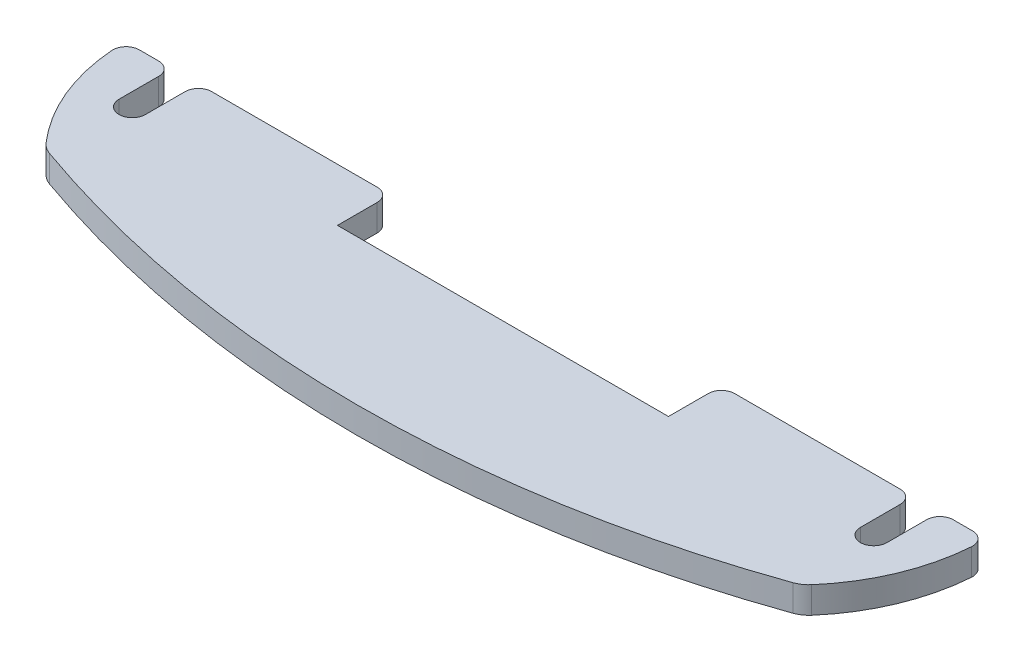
ISO-10303-21;
HEADER;
FILE_DESCRIPTION(('STEP AP214'),'2;1');
FILE_NAME('part.step','',(''),(''),'','','');
FILE_SCHEMA(('AUTOMOTIVE_DESIGN { 1 0 10303 214 1 1 1 1 }'));
ENDSEC;
DATA;
#1=APPLICATION_CONTEXT('core data for automotive mechanical design processes');
#2=APPLICATION_PROTOCOL_DEFINITION('international standard','automotive_design',2000,#1);
#3=PRODUCT_CONTEXT('',#1,'mechanical');
#4=PRODUCT('Part','Part','',(#3));
#5=PRODUCT_RELATED_PRODUCT_CATEGORY('part','',(#4));
#6=PRODUCT_DEFINITION_FORMATION('','',#4);
#7=PRODUCT_DEFINITION_CONTEXT('part definition',#1,'design');
#8=PRODUCT_DEFINITION('design','',#6,#7);
#9=PRODUCT_DEFINITION_SHAPE('','',#8);
#10=(LENGTH_UNIT() NAMED_UNIT(*) SI_UNIT(.MILLI.,.METRE.));
#11=(NAMED_UNIT(*) PLANE_ANGLE_UNIT() SI_UNIT($,.RADIAN.));
#12=(NAMED_UNIT(*) SI_UNIT($,.STERADIAN.) SOLID_ANGLE_UNIT());
#13=UNCERTAINTY_MEASURE_WITH_UNIT(LENGTH_MEASURE(1.E-05),#10,'distance_accuracy_value','');
#14=(GEOMETRIC_REPRESENTATION_CONTEXT(3) GLOBAL_UNCERTAINTY_ASSIGNED_CONTEXT((#13)) GLOBAL_UNIT_ASSIGNED_CONTEXT((#10,
#11,#12)) REPRESENTATION_CONTEXT('',''));
#15=CARTESIAN_POINT('',(0.,0.,0.));
#16=DIRECTION('',(0.,0.,1.));
#17=DIRECTION('',(1.,0.,0.));
#18=AXIS2_PLACEMENT_3D('',#15,#16,#17);
#19=CARTESIAN_POINT('',(12.5,2.,0.));
#20=DIRECTION('',(1.,0.,0.));
#21=DIRECTION('',(0.,0.,-1.));
#22=AXIS2_PLACEMENT_3D('',#19,#20,#21);
#23=PLANE('',#22);
#24=DIRECTION('',(0.,0.,1.));
#25=VECTOR('',#24,1.);
#26=CARTESIAN_POINT('',(12.5,0.,0.));
#27=LINE('',#26,#25);
#28=CARTESIAN_POINT('',(12.5,0.,-2.99999999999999));
#29=VERTEX_POINT('',#28);
#30=CARTESIAN_POINT('',(12.5,0.,0.));
#31=VERTEX_POINT('',#30);
#32=EDGE_CURVE('E236',#29,#31,#27,.T.);
#33=ORIENTED_EDGE('',*,*,#32,.T.);
#34=DIRECTION('',(0.,-1.,0.));
#35=VECTOR('',#34,1.);
#36=CARTESIAN_POINT('',(12.5,2.,0.));
#37=LINE('',#36,#35);
#38=CARTESIAN_POINT('',(12.5,2.,0.));
#39=VERTEX_POINT('',#38);
#40=EDGE_CURVE('E11',#39,#31,#37,.T.);
#41=ORIENTED_EDGE('',*,*,#40,.F.);
#42=DIRECTION('',(0.,0.,1.));
#43=VECTOR('',#42,1.);
#44=CARTESIAN_POINT('',(12.5,2.,0.));
#45=LINE('',#44,#43);
#46=CARTESIAN_POINT('',(12.5,2.,-2.99999999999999));
#47=VERTEX_POINT('',#46);
#48=EDGE_CURVE('E287',#47,#39,#45,.T.);
#49=ORIENTED_EDGE('',*,*,#48,.F.);
#50=DIRECTION('',(0.,-1.,0.));
#51=VECTOR('',#50,1.);
#52=CARTESIAN_POINT('',(12.5,2.,-2.99999999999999));
#53=LINE('',#52,#51);
#54=EDGE_CURVE('E232',#47,#29,#53,.T.);
#55=ORIENTED_EDGE('',*,*,#54,.T.);
#56=EDGE_LOOP('',(#33,#41,#49,#55));
#57=FACE_BOUND('',#56,.T.);
#58=ADVANCED_FACE('F32',(#57),#23,.F.);
#59=CARTESIAN_POINT('',(-12.5,2.,0.));
#60=DIRECTION('',(0.,0.,1.));
#61=DIRECTION('',(1.,0.,0.));
#62=AXIS2_PLACEMENT_3D('',#59,#60,#61);
#63=PLANE('',#62);
#64=DIRECTION('',(-1.,0.,0.));
#65=VECTOR('',#64,1.);
#66=CARTESIAN_POINT('',(-12.5,0.,0.));
#67=LINE('',#66,#65);
#68=CARTESIAN_POINT('',(-12.5,0.,0.));
#69=VERTEX_POINT('',#68);
#70=EDGE_CURVE('E239',#31,#69,#67,.T.);
#71=ORIENTED_EDGE('',*,*,#70,.T.);
#72=DIRECTION('',(0.,-1.,0.));
#73=VECTOR('',#72,1.);
#74=CARTESIAN_POINT('',(-12.5,2.,0.));
#75=LINE('',#74,#73);
#76=CARTESIAN_POINT('',(-12.5,2.,0.));
#77=VERTEX_POINT('',#76);
#78=EDGE_CURVE('E40',#77,#69,#75,.T.);
#79=ORIENTED_EDGE('',*,*,#78,.F.);
#80=DIRECTION('',(-1.,0.,0.));
#81=VECTOR('',#80,1.);
#82=CARTESIAN_POINT('',(-12.5,2.,0.));
#83=LINE('',#82,#81);
#84=EDGE_CURVE('E145',#39,#77,#83,.T.);
#85=ORIENTED_EDGE('',*,*,#84,.F.);
#86=ORIENTED_EDGE('',*,*,#40,.T.);
#87=EDGE_LOOP('',(#71,#79,#85,#86));
#88=FACE_BOUND('',#87,.T.);
#89=ADVANCED_FACE('F435',(#88),#63,.F.);
#90=CARTESIAN_POINT('',(-12.5,2.,0.));
#91=DIRECTION('',(-1.,0.,0.));
#92=DIRECTION('',(0.,0.,1.));
#93=AXIS2_PLACEMENT_3D('',#90,#91,#92);
#94=PLANE('',#93);
#95=DIRECTION('',(0.,0.,-1.));
#96=VECTOR('',#95,1.);
#97=CARTESIAN_POINT('',(-12.5,0.,0.));
#98=LINE('',#97,#96);
#99=CARTESIAN_POINT('',(-12.5,0.,-2.99999999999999));
#100=VERTEX_POINT('',#99);
#101=EDGE_CURVE('E241',#69,#100,#98,.T.);
#102=ORIENTED_EDGE('',*,*,#101,.T.);
#103=DIRECTION('',(0.,-1.,0.));
#104=VECTOR('',#103,1.);
#105=CARTESIAN_POINT('',(-12.5,2.,-2.99999999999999));
#106=LINE('',#105,#104);
#107=CARTESIAN_POINT('',(-12.5,2.,-2.99999999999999));
#108=VERTEX_POINT('',#107);
#109=EDGE_CURVE('E348',#108,#100,#106,.T.);
#110=ORIENTED_EDGE('',*,*,#109,.F.);
#111=DIRECTION('',(0.,0.,-1.));
#112=VECTOR('',#111,1.);
#113=CARTESIAN_POINT('',(-12.5,2.,0.));
#114=LINE('',#113,#112);
#115=EDGE_CURVE('E356',#77,#108,#114,.T.);
#116=ORIENTED_EDGE('',*,*,#115,.F.);
#117=ORIENTED_EDGE('',*,*,#78,.T.);
#118=EDGE_LOOP('',(#102,#110,#116,#117));
#119=FACE_BOUND('',#118,.T.);
#120=ADVANCED_FACE('F354',(#119),#94,.F.);
#121=CARTESIAN_POINT('',(-13.5,2.,-3.));
#122=DIRECTION('',(0.,-1.,0.));
#123=DIRECTION('',(0.,0.,-1.));
#124=AXIS2_PLACEMENT_3D('',#121,#122,#123);
#125=CYLINDRICAL_SURFACE('',#124,1.);
#126=CARTESIAN_POINT('',(-13.5,0.,-3.));
#127=DIRECTION('',(0.,1.,0.));
#128=DIRECTION('',(0.,0.,-1.));
#129=AXIS2_PLACEMENT_3D('',#126,#127,#128);
#130=CIRCLE('',#129,1.);
#131=CARTESIAN_POINT('',(-13.5,0.,-4.));
#132=VERTEX_POINT('',#131);
#133=EDGE_CURVE('E243',#100,#132,#130,.T.);
#134=ORIENTED_EDGE('',*,*,#133,.T.);
#135=DIRECTION('',(0.,-1.,0.));
#136=VECTOR('',#135,1.);
#137=CARTESIAN_POINT('',(-13.5,2.,-4.));
#138=LINE('',#137,#136);
#139=CARTESIAN_POINT('',(-13.5,2.,-4.));
#140=VERTEX_POINT('',#139);
#141=EDGE_CURVE('E345',#140,#132,#138,.T.);
#142=ORIENTED_EDGE('',*,*,#141,.F.);
#143=CARTESIAN_POINT('',(-13.5,2.,-3.));
#144=DIRECTION('',(0.,1.,0.));
#145=DIRECTION('',(0.,0.,-1.));
#146=AXIS2_PLACEMENT_3D('',#143,#144,#145);
#147=CIRCLE('',#146,1.);
#148=EDGE_CURVE('E374',#108,#140,#147,.T.);
#149=ORIENTED_EDGE('',*,*,#148,.F.);
#150=ORIENTED_EDGE('',*,*,#109,.T.);
#151=EDGE_LOOP('',(#134,#142,#149,#150));
#152=FACE_BOUND('',#151,.T.);
#153=ADVANCED_FACE('F365',(#152),#125,.T.);
#154=CARTESIAN_POINT('',(-13.5,2.,-4.));
#155=DIRECTION('',(0.,0.,1.));
#156=DIRECTION('',(1.,0.,0.));
#157=AXIS2_PLACEMENT_3D('',#154,#155,#156);
#158=PLANE('',#157);
#159=DIRECTION('',(-1.,0.,0.));
#160=VECTOR('',#159,1.);
#161=CARTESIAN_POINT('',(-13.5,0.,-4.));
#162=LINE('',#161,#160);
#163=CARTESIAN_POINT('',(-26.,0.,-4.));
#164=VERTEX_POINT('',#163);
#165=EDGE_CURVE('E245',#132,#164,#162,.T.);
#166=ORIENTED_EDGE('',*,*,#165,.T.);
#167=DIRECTION('',(0.,-1.,0.));
#168=VECTOR('',#167,1.);
#169=CARTESIAN_POINT('',(-26.,2.,-4.));
#170=LINE('',#169,#168);
#171=CARTESIAN_POINT('',(-26.,2.,-4.));
#172=VERTEX_POINT('',#171);
#173=EDGE_CURVE('E342',#172,#164,#170,.T.);
#174=ORIENTED_EDGE('',*,*,#173,.F.);
#175=DIRECTION('',(-1.,0.,0.));
#176=VECTOR('',#175,1.);
#177=CARTESIAN_POINT('',(-13.5,2.,-4.));
#178=LINE('',#177,#176);
#179=EDGE_CURVE('E371',#140,#172,#178,.T.);
#180=ORIENTED_EDGE('',*,*,#179,.F.);
#181=ORIENTED_EDGE('',*,*,#141,.T.);
#182=EDGE_LOOP('',(#166,#174,#180,#181));
#183=FACE_BOUND('',#182,.T.);
#184=ADVANCED_FACE('F369',(#183),#158,.F.);
#185=CARTESIAN_POINT('',(-26.,2.,-3.));
#186=DIRECTION('',(0.,-1.,0.));
#187=DIRECTION('',(0.,0.,-1.));
#188=AXIS2_PLACEMENT_3D('',#185,#186,#187);
#189=CYLINDRICAL_SURFACE('',#188,1.);
#190=CARTESIAN_POINT('',(-26.,0.,-3.));
#191=DIRECTION('',(0.,1.,0.));
#192=DIRECTION('',(0.,0.,-1.));
#193=AXIS2_PLACEMENT_3D('',#190,#191,#192);
#194=CIRCLE('',#193,1.);
#195=CARTESIAN_POINT('',(-27.,0.,-2.99999999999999));
#196=VERTEX_POINT('',#195);
#197=EDGE_CURVE('E247',#164,#196,#194,.T.);
#198=ORIENTED_EDGE('',*,*,#197,.T.);
#199=DIRECTION('',(0.,-1.,0.));
#200=VECTOR('',#199,1.);
#201=CARTESIAN_POINT('',(-27.,2.,-2.99999999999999));
#202=LINE('',#201,#200);
#203=CARTESIAN_POINT('',(-27.,2.,-2.99999999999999));
#204=VERTEX_POINT('',#203);
#205=EDGE_CURVE('E339',#204,#196,#202,.T.);
#206=ORIENTED_EDGE('',*,*,#205,.F.);
#207=CARTESIAN_POINT('',(-26.,2.,-3.));
#208=DIRECTION('',(0.,1.,0.));
#209=DIRECTION('',(0.,0.,-1.));
#210=AXIS2_PLACEMENT_3D('',#207,#208,#209);
#211=CIRCLE('',#210,1.);
#212=EDGE_CURVE('E373',#172,#204,#211,.T.);
#213=ORIENTED_EDGE('',*,*,#212,.F.);
#214=ORIENTED_EDGE('',*,*,#173,.T.);
#215=EDGE_LOOP('',(#198,#206,#213,#214));
#216=FACE_BOUND('',#215,.T.);
#217=ADVANCED_FACE('F448',(#216),#189,.T.);
#218=CARTESIAN_POINT('',(-27.,2.,-2.99999999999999));
#219=DIRECTION('',(1.,0.,0.));
#220=DIRECTION('',(0.,0.,-1.));
#221=AXIS2_PLACEMENT_3D('',#218,#219,#220);
#222=PLANE('',#221);
#223=DIRECTION('',(0.,0.,1.));
#224=VECTOR('',#223,1.);
#225=CARTESIAN_POINT('',(-27.,0.,-2.99999999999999));
#226=LINE('',#225,#224);
#227=CARTESIAN_POINT('',(-27.,0.,0.));
#228=VERTEX_POINT('',#227);
#229=EDGE_CURVE('E249',#196,#228,#226,.T.);
#230=ORIENTED_EDGE('',*,*,#229,.T.);
#231=DIRECTION('',(0.,-1.,0.));
#232=VECTOR('',#231,1.);
#233=CARTESIAN_POINT('',(-27.,2.,0.));
#234=LINE('',#233,#232);
#235=CARTESIAN_POINT('',(-27.,2.,0.));
#236=VERTEX_POINT('',#235);
#237=EDGE_CURVE('E336',#236,#228,#234,.T.);
#238=ORIENTED_EDGE('',*,*,#237,.F.);
#239=DIRECTION('',(0.,0.,1.));
#240=VECTOR('',#239,1.);
#241=CARTESIAN_POINT('',(-27.,2.,-2.99999999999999));
#242=LINE('',#241,#240);
#243=EDGE_CURVE('E376',#204,#236,#242,.T.);
#244=ORIENTED_EDGE('',*,*,#243,.F.);
#245=ORIENTED_EDGE('',*,*,#205,.T.);
#246=EDGE_LOOP('',(#230,#238,#244,#245));
#247=FACE_BOUND('',#246,.T.);
#248=ADVANCED_FACE('F451',(#247),#222,.F.);
#249=CARTESIAN_POINT('',(-28.,2.,0.));
#250=DIRECTION('',(0.,-1.,0.));
#251=DIRECTION('',(0.,0.,-1.));
#252=AXIS2_PLACEMENT_3D('',#249,#250,#251);
#253=CYLINDRICAL_SURFACE('',#252,1.);
#254=CARTESIAN_POINT('',(-28.,0.,0.));
#255=DIRECTION('',(0.,-1.,0.));
#256=DIRECTION('',(0.,0.,-1.));
#257=AXIS2_PLACEMENT_3D('',#254,#255,#256);
#258=CIRCLE('',#257,1.);
#259=CARTESIAN_POINT('',(-29.,0.,0.));
#260=VERTEX_POINT('',#259);
#261=EDGE_CURVE('E251',#228,#260,#258,.T.);
#262=ORIENTED_EDGE('',*,*,#261,.T.);
#263=DIRECTION('',(0.,-1.,0.));
#264=VECTOR('',#263,1.);
#265=CARTESIAN_POINT('',(-29.,2.,0.));
#266=LINE('',#265,#264);
#267=CARTESIAN_POINT('',(-29.,2.,0.));
#268=VERTEX_POINT('',#267);
#269=EDGE_CURVE('E333',#268,#260,#266,.T.);
#270=ORIENTED_EDGE('',*,*,#269,.F.);
#271=CARTESIAN_POINT('',(-28.,2.,0.));
#272=DIRECTION('',(0.,-1.,0.));
#273=DIRECTION('',(0.,0.,-1.));
#274=AXIS2_PLACEMENT_3D('',#271,#272,#273);
#275=CIRCLE('',#274,1.);
#276=EDGE_CURVE('E382',#236,#268,#275,.T.);
#277=ORIENTED_EDGE('',*,*,#276,.F.);
#278=ORIENTED_EDGE('',*,*,#237,.T.);
#279=EDGE_LOOP('',(#262,#270,#277,#278));
#280=FACE_BOUND('',#279,.T.);
#281=ADVANCED_FACE('F455',(#280),#253,.F.);
#282=CARTESIAN_POINT('',(-29.,2.,-2.99999999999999));
#283=DIRECTION('',(-1.,0.,0.));
#284=DIRECTION('',(0.,0.,1.));
#285=AXIS2_PLACEMENT_3D('',#282,#283,#284);
#286=PLANE('',#285);
#287=DIRECTION('',(0.,0.,-1.));
#288=VECTOR('',#287,1.);
#289=CARTESIAN_POINT('',(-29.,0.,-2.99999999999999));
#290=LINE('',#289,#288);
#291=CARTESIAN_POINT('',(-29.,0.,-2.99999999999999));
#292=VERTEX_POINT('',#291);
#293=EDGE_CURVE('E253',#260,#292,#290,.T.);
#294=ORIENTED_EDGE('',*,*,#293,.T.);
#295=DIRECTION('',(0.,-1.,0.));
#296=VECTOR('',#295,1.);
#297=CARTESIAN_POINT('',(-29.,2.,-2.99999999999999));
#298=LINE('',#297,#296);
#299=CARTESIAN_POINT('',(-29.,2.,-2.99999999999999));
#300=VERTEX_POINT('',#299);
#301=EDGE_CURVE('E330',#300,#292,#298,.T.);
#302=ORIENTED_EDGE('',*,*,#301,.F.);
#303=DIRECTION('',(0.,0.,-1.));
#304=VECTOR('',#303,1.);
#305=CARTESIAN_POINT('',(-29.,2.,-2.99999999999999));
#306=LINE('',#305,#304);
#307=EDGE_CURVE('E384',#268,#300,#306,.T.);
#308=ORIENTED_EDGE('',*,*,#307,.F.);
#309=ORIENTED_EDGE('',*,*,#269,.T.);
#310=EDGE_LOOP('',(#294,#302,#308,#309));
#311=FACE_BOUND('',#310,.T.);
#312=ADVANCED_FACE('F459',(#311),#286,.F.);
#313=CARTESIAN_POINT('',(-30.,2.,-3.));
#314=DIRECTION('',(0.,-1.,0.));
#315=DIRECTION('',(0.,0.,-1.));
#316=AXIS2_PLACEMENT_3D('',#313,#314,#315);
#317=CYLINDRICAL_SURFACE('',#316,1.);
#318=CARTESIAN_POINT('',(-30.,0.,-3.));
#319=DIRECTION('',(0.,1.,0.));
#320=DIRECTION('',(0.,0.,-1.));
#321=AXIS2_PLACEMENT_3D('',#318,#319,#320);
#322=CIRCLE('',#321,1.);
#323=CARTESIAN_POINT('',(-30.,0.,-4.));
#324=VERTEX_POINT('',#323);
#325=EDGE_CURVE('E255',#292,#324,#322,.T.);
#326=ORIENTED_EDGE('',*,*,#325,.T.);
#327=DIRECTION('',(0.,-1.,0.));
#328=VECTOR('',#327,1.);
#329=CARTESIAN_POINT('',(-30.,2.,-4.));
#330=LINE('',#329,#328);
#331=CARTESIAN_POINT('',(-30.,2.,-4.));
#332=VERTEX_POINT('',#331);
#333=EDGE_CURVE('E327',#332,#324,#330,.T.);
#334=ORIENTED_EDGE('',*,*,#333,.F.);
#335=CARTESIAN_POINT('',(-30.,2.,-3.));
#336=DIRECTION('',(0.,1.,0.));
#337=DIRECTION('',(0.,0.,-1.));
#338=AXIS2_PLACEMENT_3D('',#335,#336,#337);
#339=CIRCLE('',#338,1.);
#340=EDGE_CURVE('E386',#300,#332,#339,.T.);
#341=ORIENTED_EDGE('',*,*,#340,.F.);
#342=ORIENTED_EDGE('',*,*,#301,.T.);
#343=EDGE_LOOP('',(#326,#334,#341,#342));
#344=FACE_BOUND('',#343,.T.);
#345=ADVANCED_FACE('F463',(#344),#317,.T.);
#346=CARTESIAN_POINT('',(-30.,2.,-4.));
#347=DIRECTION('',(0.,0.,1.));
#348=DIRECTION('',(1.,0.,0.));
#349=AXIS2_PLACEMENT_3D('',#346,#347,#348);
#350=PLANE('',#349);
#351=DIRECTION('',(-1.,0.,0.));
#352=VECTOR('',#351,1.);
#353=CARTESIAN_POINT('',(-30.,0.,-4.));
#354=LINE('',#353,#352);
#355=CARTESIAN_POINT('',(-31.4632395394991,0.,-4.));
#356=VERTEX_POINT('',#355);
#357=EDGE_CURVE('E257',#324,#356,#354,.T.);
#358=ORIENTED_EDGE('',*,*,#357,.T.);
#359=DIRECTION('',(0.,-1.,0.));
#360=VECTOR('',#359,1.);
#361=CARTESIAN_POINT('',(-31.4632395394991,2.,-4.));
#362=LINE('',#361,#360);
#363=CARTESIAN_POINT('',(-31.4632395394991,2.,-4.));
#364=VERTEX_POINT('',#363);
#365=EDGE_CURVE('E324',#364,#356,#362,.T.);
#366=ORIENTED_EDGE('',*,*,#365,.F.);
#367=DIRECTION('',(-1.,0.,0.));
#368=VECTOR('',#367,1.);
#369=CARTESIAN_POINT('',(-30.,2.,-4.));
#370=LINE('',#369,#368);
#371=EDGE_CURVE('E388',#332,#364,#370,.T.);
#372=ORIENTED_EDGE('',*,*,#371,.F.);
#373=ORIENTED_EDGE('',*,*,#333,.T.);
#374=EDGE_LOOP('',(#358,#366,#372,#373));
#375=FACE_BOUND('',#374,.T.);
#376=ADVANCED_FACE('F467',(#375),#350,.F.);
#377=CARTESIAN_POINT('',(-31.4632395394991,2.,-3.));
#378=DIRECTION('',(0.,-1.,0.));
#379=DIRECTION('',(0.,0.,-1.));
#380=AXIS2_PLACEMENT_3D('',#377,#378,#379);
#381=CYLINDRICAL_SURFACE('',#380,1.);
#382=CARTESIAN_POINT('',(-31.4632395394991,0.,-3.));
#383=DIRECTION('',(0.,1.,0.));
#384=DIRECTION('',(0.,0.,-1.));
#385=AXIS2_PLACEMENT_3D('',#382,#383,#384);
#386=CIRCLE('',#385,1.);
#387=CARTESIAN_POINT('',(-32.4605405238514,0.,-2.92657829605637));
#388=VERTEX_POINT('',#387);
#389=EDGE_CURVE('E259',#356,#388,#386,.T.);
#390=ORIENTED_EDGE('',*,*,#389,.T.);
#391=DIRECTION('',(0.,-1.,0.));
#392=VECTOR('',#391,1.);
#393=CARTESIAN_POINT('',(-32.4605405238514,2.,-2.92657829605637));
#394=LINE('',#393,#392);
#395=CARTESIAN_POINT('',(-32.4605405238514,2.,-2.92657829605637));
#396=VERTEX_POINT('',#395);
#397=EDGE_CURVE('E321',#396,#388,#394,.T.);
#398=ORIENTED_EDGE('',*,*,#397,.F.);
#399=CARTESIAN_POINT('',(-31.4632395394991,2.,-3.));
#400=DIRECTION('',(0.,1.,0.));
#401=DIRECTION('',(0.,0.,-1.));
#402=AXIS2_PLACEMENT_3D('',#399,#400,#401);
#403=CIRCLE('',#402,1.);
#404=EDGE_CURVE('E390',#364,#396,#403,.T.);
#405=ORIENTED_EDGE('',*,*,#404,.F.);
#406=ORIENTED_EDGE('',*,*,#365,.T.);
#407=EDGE_LOOP('',(#390,#398,#405,#406));
#408=FACE_BOUND('',#407,.T.);
#409=ADVANCED_FACE('F471',(#408),#381,.T.);
#410=CARTESIAN_POINT('',(-17.8800491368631,2.,-4.));
#411=DIRECTION('',(0.,-1.,0.));
#412=DIRECTION('',(0.,0.,-1.));
#413=AXIS2_PLACEMENT_3D('',#410,#411,#412);
#414=CYLINDRICAL_SURFACE('',#413,14.6199508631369);
#415=CARTESIAN_POINT('',(-17.8800491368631,0.,-4.));
#416=DIRECTION('',(0.,1.,0.));
#417=DIRECTION('',(0.,0.,1.));
#418=AXIS2_PLACEMENT_3D('',#415,#416,#417);
#419=CIRCLE('',#418,14.6199508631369);
#420=CARTESIAN_POINT('',(-28.9071009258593,0.,5.5993276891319));
#421=VERTEX_POINT('',#420);
#422=EDGE_CURVE('E261',#388,#421,#419,.T.);
#423=ORIENTED_EDGE('',*,*,#422,.T.);
#424=DIRECTION('',(0.,-1.,0.));
#425=VECTOR('',#424,1.);
#426=CARTESIAN_POINT('',(-28.9071009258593,2.,5.5993276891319));
#427=LINE('',#426,#425);
#428=CARTESIAN_POINT('',(-28.9071009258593,2.,5.5993276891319));
#429=VERTEX_POINT('',#428);
#430=EDGE_CURVE('E318',#429,#421,#427,.T.);
#431=ORIENTED_EDGE('',*,*,#430,.F.);
#432=CARTESIAN_POINT('',(-17.8800491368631,2.,-4.));
#433=DIRECTION('',(0.,1.,0.));
#434=DIRECTION('',(0.,0.,1.));
#435=AXIS2_PLACEMENT_3D('',#432,#433,#434);
#436=CIRCLE('',#435,14.6199508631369);
#437=EDGE_CURVE('E392',#396,#429,#436,.T.);
#438=ORIENTED_EDGE('',*,*,#437,.F.);
#439=ORIENTED_EDGE('',*,*,#397,.T.);
#440=EDGE_LOOP('',(#423,#431,#438,#439));
#441=FACE_BOUND('',#440,.T.);
#442=ADVANCED_FACE('F475',(#441),#414,.T.);
#443=CARTESIAN_POINT('',(-27.398607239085,2.,4.2861457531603));
#444=DIRECTION('',(0.,-1.,0.));
#445=DIRECTION('',(0.,0.,-1.));
#446=AXIS2_PLACEMENT_3D('',#443,#444,#445);
#447=CYLINDRICAL_SURFACE('',#446,2.00000000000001);
#448=CARTESIAN_POINT('',(-27.398607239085,0.,4.2861457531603));
#449=DIRECTION('',(0.,1.,0.));
#450=DIRECTION('',(0.,0.,1.));
#451=AXIS2_PLACEMENT_3D('',#448,#449,#450);
#452=CIRCLE('',#451,2.00000000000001);
#453=CARTESIAN_POINT('',(-28.0670112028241,0.,6.17114870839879));
#454=VERTEX_POINT('',#453);
#455=EDGE_CURVE('E263',#421,#454,#452,.T.);
#456=ORIENTED_EDGE('',*,*,#455,.T.);
#457=DIRECTION('',(0.,-1.,0.));
#458=VECTOR('',#457,1.);
#459=CARTESIAN_POINT('',(-28.0670112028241,2.,6.17114870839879));
#460=LINE('',#459,#458);
#461=CARTESIAN_POINT('',(-28.0670112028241,2.,6.17114870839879));
#462=VERTEX_POINT('',#461);
#463=EDGE_CURVE('E315',#462,#454,#460,.T.);
#464=ORIENTED_EDGE('',*,*,#463,.F.);
#465=CARTESIAN_POINT('',(-27.398607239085,2.,4.2861457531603));
#466=DIRECTION('',(0.,1.,0.));
#467=DIRECTION('',(0.,0.,1.));
#468=AXIS2_PLACEMENT_3D('',#465,#466,#467);
#469=CIRCLE('',#468,2.00000000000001);
#470=EDGE_CURVE('E394',#429,#462,#469,.T.);
#471=ORIENTED_EDGE('',*,*,#470,.F.);
#472=ORIENTED_EDGE('',*,*,#430,.T.);
#473=EDGE_LOOP('',(#456,#464,#471,#472));
#474=FACE_BOUND('',#473,.T.);
#475=ADVANCED_FACE('F479',(#474),#447,.T.);
#476=CARTESIAN_POINT('',(0.,2.,-72.9821806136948));
#477=DIRECTION('',(0.,-1.,0.));
#478=DIRECTION('',(0.,0.,-1.));
#479=AXIS2_PLACEMENT_3D('',#476,#477,#478);
#480=CYLINDRICAL_SURFACE('',#479,83.9821806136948);
#481=CARTESIAN_POINT('',(0.,0.,-72.9821806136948));
#482=DIRECTION('',(0.,1.,0.));
#483=DIRECTION('',(0.,0.,-1.));
#484=AXIS2_PLACEMENT_3D('',#481,#482,#483);
#485=CIRCLE('',#484,83.9821806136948);
#486=CARTESIAN_POINT('',(28.0670112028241,0.,6.1711487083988));
#487=VERTEX_POINT('',#486);
#488=EDGE_CURVE('E266',#454,#487,#485,.T.);
#489=ORIENTED_EDGE('',*,*,#488,.T.);
#490=DIRECTION('',(0.,-1.,0.));
#491=VECTOR('',#490,1.);
#492=CARTESIAN_POINT('',(28.0670112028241,2.,6.1711487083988));
#493=LINE('',#492,#491);
#494=CARTESIAN_POINT('',(28.0670112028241,2.,6.1711487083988));
#495=VERTEX_POINT('',#494);
#496=EDGE_CURVE('E312',#495,#487,#493,.T.);
#497=ORIENTED_EDGE('',*,*,#496,.F.);
#498=CARTESIAN_POINT('',(0.,2.,-72.9821806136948));
#499=DIRECTION('',(0.,1.,0.));
#500=DIRECTION('',(0.,0.,1.));
#501=AXIS2_PLACEMENT_3D('',#498,#499,#500);
#502=CIRCLE('',#501,83.9821806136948);
#503=EDGE_CURVE('E396',#462,#495,#502,.T.);
#504=ORIENTED_EDGE('',*,*,#503,.F.);
#505=ORIENTED_EDGE('',*,*,#463,.T.);
#506=EDGE_LOOP('',(#489,#497,#504,#505));
#507=FACE_BOUND('',#506,.T.);
#508=ADVANCED_FACE('F483',(#507),#480,.T.);
#509=CARTESIAN_POINT('',(27.398607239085,2.,4.28614575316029));
#510=DIRECTION('',(0.,-1.,0.));
#511=DIRECTION('',(0.,0.,-1.));
#512=AXIS2_PLACEMENT_3D('',#509,#510,#511);
#513=CYLINDRICAL_SURFACE('',#512,2.00000000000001);
#514=CARTESIAN_POINT('',(27.398607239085,0.,4.28614575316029));
#515=DIRECTION('',(0.,1.,0.));
#516=DIRECTION('',(0.,0.,-1.));
#517=AXIS2_PLACEMENT_3D('',#514,#515,#516);
#518=CIRCLE('',#517,2.00000000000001);
#519=CARTESIAN_POINT('',(28.9071009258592,0.,5.5993276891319));
#520=VERTEX_POINT('',#519);
#521=EDGE_CURVE('E268',#487,#520,#518,.T.);
#522=ORIENTED_EDGE('',*,*,#521,.T.);
#523=DIRECTION('',(0.,-1.,0.));
#524=VECTOR('',#523,1.);
#525=CARTESIAN_POINT('',(28.9071009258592,2.,5.5993276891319));
#526=LINE('',#525,#524);
#527=CARTESIAN_POINT('',(28.9071009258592,2.,5.5993276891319));
#528=VERTEX_POINT('',#527);
#529=EDGE_CURVE('E309',#528,#520,#526,.T.);
#530=ORIENTED_EDGE('',*,*,#529,.F.);
#531=CARTESIAN_POINT('',(27.398607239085,2.,4.28614575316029));
#532=DIRECTION('',(0.,1.,0.));
#533=DIRECTION('',(0.,0.,-1.));
#534=AXIS2_PLACEMENT_3D('',#531,#532,#533);
#535=CIRCLE('',#534,2.00000000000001);
#536=EDGE_CURVE('E398',#495,#528,#535,.T.);
#537=ORIENTED_EDGE('',*,*,#536,.F.);
#538=ORIENTED_EDGE('',*,*,#496,.T.);
#539=EDGE_LOOP('',(#522,#530,#537,#538));
#540=FACE_BOUND('',#539,.T.);
#541=ADVANCED_FACE('F487',(#540),#513,.T.);
#542=CARTESIAN_POINT('',(17.8800491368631,2.,-4.));
#543=DIRECTION('',(0.,-1.,0.));
#544=DIRECTION('',(0.,0.,-1.));
#545=AXIS2_PLACEMENT_3D('',#542,#543,#544);
#546=CYLINDRICAL_SURFACE('',#545,14.6199508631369);
#547=CARTESIAN_POINT('',(17.8800491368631,0.,-4.));
#548=DIRECTION('',(0.,1.,0.));
#549=DIRECTION('',(0.,0.,-1.));
#550=AXIS2_PLACEMENT_3D('',#547,#548,#549);
#551=CIRCLE('',#550,14.6199508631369);
#552=CARTESIAN_POINT('',(32.4605405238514,0.,-2.92657829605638));
#553=VERTEX_POINT('',#552);
#554=EDGE_CURVE('E270',#520,#553,#551,.T.);
#555=ORIENTED_EDGE('',*,*,#554,.T.);
#556=DIRECTION('',(0.,-1.,0.));
#557=VECTOR('',#556,1.);
#558=CARTESIAN_POINT('',(32.4605405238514,2.,-2.92657829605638));
#559=LINE('',#558,#557);
#560=CARTESIAN_POINT('',(32.4605405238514,2.,-2.92657829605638));
#561=VERTEX_POINT('',#560);
#562=EDGE_CURVE('E306',#561,#553,#559,.T.);
#563=ORIENTED_EDGE('',*,*,#562,.F.);
#564=CARTESIAN_POINT('',(17.8800491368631,2.,-4.));
#565=DIRECTION('',(0.,1.,0.));
#566=DIRECTION('',(0.,0.,-1.));
#567=AXIS2_PLACEMENT_3D('',#564,#565,#566);
#568=CIRCLE('',#567,14.6199508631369);
#569=EDGE_CURVE('E400',#528,#561,#568,.T.);
#570=ORIENTED_EDGE('',*,*,#569,.F.);
#571=ORIENTED_EDGE('',*,*,#529,.T.);
#572=EDGE_LOOP('',(#555,#563,#570,#571));
#573=FACE_BOUND('',#572,.T.);
#574=ADVANCED_FACE('F491',(#573),#546,.T.);
#575=CARTESIAN_POINT('',(31.4632395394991,2.,-3.00000000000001));
#576=DIRECTION('',(0.,-1.,0.));
#577=DIRECTION('',(0.,0.,-1.));
#578=AXIS2_PLACEMENT_3D('',#575,#576,#577);
#579=CYLINDRICAL_SURFACE('',#578,1.);
#580=CARTESIAN_POINT('',(31.4632395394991,0.,-3.00000000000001));
#581=DIRECTION('',(0.,1.,0.));
#582=DIRECTION('',(0.,0.,-1.));
#583=AXIS2_PLACEMENT_3D('',#580,#581,#582);
#584=CIRCLE('',#583,1.);
#585=CARTESIAN_POINT('',(31.4632395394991,0.,-4.00000000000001));
#586=VERTEX_POINT('',#585);
#587=EDGE_CURVE('E272',#553,#586,#584,.T.);
#588=ORIENTED_EDGE('',*,*,#587,.T.);
#589=DIRECTION('',(0.,-1.,0.));
#590=VECTOR('',#589,1.);
#591=CARTESIAN_POINT('',(31.4632395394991,2.,-4.00000000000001));
#592=LINE('',#591,#590);
#593=CARTESIAN_POINT('',(31.4632395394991,2.,-4.00000000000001));
#594=VERTEX_POINT('',#593);
#595=EDGE_CURVE('E303',#594,#586,#592,.T.);
#596=ORIENTED_EDGE('',*,*,#595,.F.);
#597=CARTESIAN_POINT('',(31.4632395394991,2.,-3.00000000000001));
#598=DIRECTION('',(0.,1.,0.));
#599=DIRECTION('',(0.,0.,-1.));
#600=AXIS2_PLACEMENT_3D('',#597,#598,#599);
#601=CIRCLE('',#600,1.);
#602=EDGE_CURVE('E402',#561,#594,#601,.T.);
#603=ORIENTED_EDGE('',*,*,#602,.F.);
#604=ORIENTED_EDGE('',*,*,#562,.T.);
#605=EDGE_LOOP('',(#588,#596,#603,#604));
#606=FACE_BOUND('',#605,.T.);
#607=ADVANCED_FACE('F495',(#606),#579,.T.);
#608=CARTESIAN_POINT('',(30.,2.,-4.));
#609=DIRECTION('',(0.,0.,1.));
#610=DIRECTION('',(1.,0.,0.));
#611=AXIS2_PLACEMENT_3D('',#608,#609,#610);
#612=PLANE('',#611);
#613=DIRECTION('',(-1.,0.,0.));
#614=VECTOR('',#613,1.);
#615=CARTESIAN_POINT('',(30.,0.,-4.));
#616=LINE('',#615,#614);
#617=CARTESIAN_POINT('',(30.,0.,-4.));
#618=VERTEX_POINT('',#617);
#619=EDGE_CURVE('E274',#586,#618,#616,.T.);
#620=ORIENTED_EDGE('',*,*,#619,.T.);
#621=DIRECTION('',(0.,-1.,0.));
#622=VECTOR('',#621,1.);
#623=CARTESIAN_POINT('',(30.,2.,-4.));
#624=LINE('',#623,#622);
#625=CARTESIAN_POINT('',(30.,2.,-4.));
#626=VERTEX_POINT('',#625);
#627=EDGE_CURVE('E300',#626,#618,#624,.T.);
#628=ORIENTED_EDGE('',*,*,#627,.F.);
#629=DIRECTION('',(-1.,0.,0.));
#630=VECTOR('',#629,1.);
#631=CARTESIAN_POINT('',(30.,2.,-4.));
#632=LINE('',#631,#630);
#633=EDGE_CURVE('E404',#594,#626,#632,.T.);
#634=ORIENTED_EDGE('',*,*,#633,.F.);
#635=ORIENTED_EDGE('',*,*,#595,.T.);
#636=EDGE_LOOP('',(#620,#628,#634,#635));
#637=FACE_BOUND('',#636,.T.);
#638=ADVANCED_FACE('F499',(#637),#612,.F.);
#639=CARTESIAN_POINT('',(30.,2.,-3.));
#640=DIRECTION('',(0.,-1.,0.));
#641=DIRECTION('',(0.,0.,-1.));
#642=AXIS2_PLACEMENT_3D('',#639,#640,#641);
#643=CYLINDRICAL_SURFACE('',#642,1.);
#644=CARTESIAN_POINT('',(30.,0.,-3.));
#645=DIRECTION('',(0.,1.,0.));
#646=DIRECTION('',(0.,0.,-1.));
#647=AXIS2_PLACEMENT_3D('',#644,#645,#646);
#648=CIRCLE('',#647,1.);
#649=CARTESIAN_POINT('',(29.,0.,-3.));
#650=VERTEX_POINT('',#649);
#651=EDGE_CURVE('E276',#618,#650,#648,.T.);
#652=ORIENTED_EDGE('',*,*,#651,.T.);
#653=DIRECTION('',(0.,-1.,0.));
#654=VECTOR('',#653,1.);
#655=CARTESIAN_POINT('',(29.,2.,-3.));
#656=LINE('',#655,#654);
#657=CARTESIAN_POINT('',(29.,2.,-3.));
#658=VERTEX_POINT('',#657);
#659=EDGE_CURVE('E297',#658,#650,#656,.T.);
#660=ORIENTED_EDGE('',*,*,#659,.F.);
#661=CARTESIAN_POINT('',(30.,2.,-3.));
#662=DIRECTION('',(0.,1.,0.));
#663=DIRECTION('',(0.,0.,-1.));
#664=AXIS2_PLACEMENT_3D('',#661,#662,#663);
#665=CIRCLE('',#664,1.);
#666=EDGE_CURVE('E406',#626,#658,#665,.T.);
#667=ORIENTED_EDGE('',*,*,#666,.F.);
#668=ORIENTED_EDGE('',*,*,#627,.T.);
#669=EDGE_LOOP('',(#652,#660,#667,#668));
#670=FACE_BOUND('',#669,.T.);
#671=ADVANCED_FACE('F503',(#670),#643,.T.);
#672=CARTESIAN_POINT('',(29.,2.,-3.));
#673=DIRECTION('',(1.,0.,0.));
#674=DIRECTION('',(0.,0.,-1.));
#675=AXIS2_PLACEMENT_3D('',#672,#673,#674);
#676=PLANE('',#675);
#677=DIRECTION('',(0.,0.,1.));
#678=VECTOR('',#677,1.);
#679=CARTESIAN_POINT('',(29.,0.,-3.));
#680=LINE('',#679,#678);
#681=CARTESIAN_POINT('',(29.,0.,0.));
#682=VERTEX_POINT('',#681);
#683=EDGE_CURVE('E278',#650,#682,#680,.T.);
#684=ORIENTED_EDGE('',*,*,#683,.T.);
#685=DIRECTION('',(0.,-1.,0.));
#686=VECTOR('',#685,1.);
#687=CARTESIAN_POINT('',(29.,2.,0.));
#688=LINE('',#687,#686);
#689=CARTESIAN_POINT('',(29.,2.,0.));
#690=VERTEX_POINT('',#689);
#691=EDGE_CURVE('E294',#690,#682,#688,.T.);
#692=ORIENTED_EDGE('',*,*,#691,.F.);
#693=DIRECTION('',(0.,0.,1.));
#694=VECTOR('',#693,1.);
#695=CARTESIAN_POINT('',(29.,2.,-3.));
#696=LINE('',#695,#694);
#697=EDGE_CURVE('E408',#658,#690,#696,.T.);
#698=ORIENTED_EDGE('',*,*,#697,.F.);
#699=ORIENTED_EDGE('',*,*,#659,.T.);
#700=EDGE_LOOP('',(#684,#692,#698,#699));
#701=FACE_BOUND('',#700,.T.);
#702=ADVANCED_FACE('F507',(#701),#676,.F.);
#703=CARTESIAN_POINT('',(28.,2.,0.));
#704=DIRECTION('',(0.,-1.,0.));
#705=DIRECTION('',(0.,0.,-1.));
#706=AXIS2_PLACEMENT_3D('',#703,#704,#705);
#707=CYLINDRICAL_SURFACE('',#706,1.);
#708=CARTESIAN_POINT('',(28.,0.,0.));
#709=DIRECTION('',(0.,-1.,0.));
#710=DIRECTION('',(0.,0.,1.));
#711=AXIS2_PLACEMENT_3D('',#708,#709,#710);
#712=CIRCLE('',#711,1.);
#713=CARTESIAN_POINT('',(27.,0.,0.));
#714=VERTEX_POINT('',#713);
#715=EDGE_CURVE('E280',#682,#714,#712,.T.);
#716=ORIENTED_EDGE('',*,*,#715,.T.);
#717=DIRECTION('',(0.,-1.,0.));
#718=VECTOR('',#717,1.);
#719=CARTESIAN_POINT('',(27.,2.,0.));
#720=LINE('',#719,#718);
#721=CARTESIAN_POINT('',(27.,2.,0.));
#722=VERTEX_POINT('',#721);
#723=EDGE_CURVE('E291',#722,#714,#720,.T.);
#724=ORIENTED_EDGE('',*,*,#723,.F.);
#725=CARTESIAN_POINT('',(28.,2.,0.));
#726=DIRECTION('',(0.,-1.,0.));
#727=DIRECTION('',(0.,0.,1.));
#728=AXIS2_PLACEMENT_3D('',#725,#726,#727);
#729=CIRCLE('',#728,1.);
#730=EDGE_CURVE('E410',#690,#722,#729,.T.);
#731=ORIENTED_EDGE('',*,*,#730,.F.);
#732=ORIENTED_EDGE('',*,*,#691,.T.);
#733=EDGE_LOOP('',(#716,#724,#731,#732));
#734=FACE_BOUND('',#733,.T.);
#735=ADVANCED_FACE('F416',(#734),#707,.F.);
#736=CARTESIAN_POINT('',(27.,2.,-2.99999999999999));
#737=DIRECTION('',(-1.,0.,0.));
#738=DIRECTION('',(0.,0.,1.));
#739=AXIS2_PLACEMENT_3D('',#736,#737,#738);
#740=PLANE('',#739);
#741=DIRECTION('',(0.,0.,-1.));
#742=VECTOR('',#741,1.);
#743=CARTESIAN_POINT('',(27.,0.,-2.99999999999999));
#744=LINE('',#743,#742);
#745=CARTESIAN_POINT('',(27.,0.,-2.99999999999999));
#746=VERTEX_POINT('',#745);
#747=EDGE_CURVE('E282',#714,#746,#744,.T.);
#748=ORIENTED_EDGE('',*,*,#747,.T.);
#749=DIRECTION('',(0.,-1.,0.));
#750=VECTOR('',#749,1.);
#751=CARTESIAN_POINT('',(27.,2.,-2.99999999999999));
#752=LINE('',#751,#750);
#753=CARTESIAN_POINT('',(27.,2.,-2.99999999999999));
#754=VERTEX_POINT('',#753);
#755=EDGE_CURVE('E227',#754,#746,#752,.T.);
#756=ORIENTED_EDGE('',*,*,#755,.F.);
#757=DIRECTION('',(0.,0.,-1.));
#758=VECTOR('',#757,1.);
#759=CARTESIAN_POINT('',(27.,2.,-2.99999999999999));
#760=LINE('',#759,#758);
#761=EDGE_CURVE('E218',#722,#754,#760,.T.);
#762=ORIENTED_EDGE('',*,*,#761,.F.);
#763=ORIENTED_EDGE('',*,*,#723,.T.);
#764=EDGE_LOOP('',(#748,#756,#762,#763));
#765=FACE_BOUND('',#764,.T.);
#766=ADVANCED_FACE('F420',(#765),#740,.F.);
#767=CARTESIAN_POINT('',(26.,2.,-3.));
#768=DIRECTION('',(0.,-1.,0.));
#769=DIRECTION('',(0.,0.,-1.));
#770=AXIS2_PLACEMENT_3D('',#767,#768,#769);
#771=CYLINDRICAL_SURFACE('',#770,1.);
#772=CARTESIAN_POINT('',(26.,0.,-3.));
#773=DIRECTION('',(0.,1.,0.));
#774=DIRECTION('',(0.,0.,1.));
#775=AXIS2_PLACEMENT_3D('',#772,#773,#774);
#776=CIRCLE('',#775,1.);
#777=CARTESIAN_POINT('',(26.,0.,-4.));
#778=VERTEX_POINT('',#777);
#779=EDGE_CURVE('E226',#746,#778,#776,.T.);
#780=ORIENTED_EDGE('',*,*,#779,.T.);
#781=DIRECTION('',(0.,-1.,0.));
#782=VECTOR('',#781,1.);
#783=CARTESIAN_POINT('',(26.,2.,-4.));
#784=LINE('',#783,#782);
#785=CARTESIAN_POINT('',(26.,2.,-4.));
#786=VERTEX_POINT('',#785);
#787=EDGE_CURVE('E223',#786,#778,#784,.T.);
#788=ORIENTED_EDGE('',*,*,#787,.F.);
#789=CARTESIAN_POINT('',(26.,2.,-3.));
#790=DIRECTION('',(0.,1.,0.));
#791=DIRECTION('',(0.,0.,1.));
#792=AXIS2_PLACEMENT_3D('',#789,#790,#791);
#793=CIRCLE('',#792,1.);
#794=EDGE_CURVE('E212',#754,#786,#793,.T.);
#795=ORIENTED_EDGE('',*,*,#794,.F.);
#796=ORIENTED_EDGE('',*,*,#755,.T.);
#797=EDGE_LOOP('',(#780,#788,#795,#796));
#798=FACE_BOUND('',#797,.T.);
#799=ADVANCED_FACE('F224',(#798),#771,.T.);
#800=CARTESIAN_POINT('',(13.5,2.,-4.));
#801=DIRECTION('',(0.,0.,1.));
#802=DIRECTION('',(1.,0.,0.));
#803=AXIS2_PLACEMENT_3D('',#800,#801,#802);
#804=PLANE('',#803);
#805=DIRECTION('',(-1.,0.,0.));
#806=VECTOR('',#805,1.);
#807=CARTESIAN_POINT('',(13.5,0.,-4.));
#808=LINE('',#807,#806);
#809=CARTESIAN_POINT('',(13.5,0.,-4.));
#810=VERTEX_POINT('',#809);
#811=EDGE_CURVE('E131',#778,#810,#808,.T.);
#812=ORIENTED_EDGE('',*,*,#811,.T.);
#813=DIRECTION('',(0.,-1.,0.));
#814=VECTOR('',#813,1.);
#815=CARTESIAN_POINT('',(13.5,2.,-4.));
#816=LINE('',#815,#814);
#817=CARTESIAN_POINT('',(13.5,2.,-4.));
#818=VERTEX_POINT('',#817);
#819=EDGE_CURVE('E228',#818,#810,#816,.T.);
#820=ORIENTED_EDGE('',*,*,#819,.F.);
#821=DIRECTION('',(-1.,0.,0.));
#822=VECTOR('',#821,1.);
#823=CARTESIAN_POINT('',(13.5,2.,-4.));
#824=LINE('',#823,#822);
#825=EDGE_CURVE('E216',#786,#818,#824,.T.);
#826=ORIENTED_EDGE('',*,*,#825,.F.);
#827=ORIENTED_EDGE('',*,*,#787,.T.);
#828=EDGE_LOOP('',(#812,#820,#826,#827));
#829=FACE_BOUND('',#828,.T.);
#830=ADVANCED_FACE('F230',(#829),#804,.F.);
#831=CARTESIAN_POINT('',(13.5,2.,-3.));
#832=DIRECTION('',(0.,-1.,0.));
#833=DIRECTION('',(0.,0.,-1.));
#834=AXIS2_PLACEMENT_3D('',#831,#832,#833);
#835=CYLINDRICAL_SURFACE('',#834,1.);
#836=CARTESIAN_POINT('',(13.5,0.,-3.));
#837=DIRECTION('',(0.,1.,0.));
#838=DIRECTION('',(0.,0.,-1.));
#839=AXIS2_PLACEMENT_3D('',#836,#837,#838);
#840=CIRCLE('',#839,1.);
#841=EDGE_CURVE('E137',#810,#29,#840,.T.);
#842=ORIENTED_EDGE('',*,*,#841,.T.);
#843=ORIENTED_EDGE('',*,*,#54,.F.);
#844=CARTESIAN_POINT('',(13.5,2.,-3.));
#845=DIRECTION('',(0.,1.,0.));
#846=DIRECTION('',(0.,0.,-1.));
#847=AXIS2_PLACEMENT_3D('',#844,#845,#846);
#848=CIRCLE('',#847,1.);
#849=EDGE_CURVE('E48',#818,#47,#848,.T.);
#850=ORIENTED_EDGE('',*,*,#849,.F.);
#851=ORIENTED_EDGE('',*,*,#819,.T.);
#852=EDGE_LOOP('',(#842,#843,#850,#851));
#853=FACE_BOUND('',#852,.T.);
#854=ADVANCED_FACE('F424',(#853),#835,.T.);
#855=CARTESIAN_POINT('',(13.5,2.,-3.));
#856=DIRECTION('',(0.,-1.,0.));
#857=DIRECTION('',(0.,0.,-1.));
#858=AXIS2_PLACEMENT_3D('',#855,#856,#857);
#859=PLANE('',#858);
#860=ORIENTED_EDGE('',*,*,#48,.T.);
#861=ORIENTED_EDGE('',*,*,#84,.T.);
#862=ORIENTED_EDGE('',*,*,#115,.T.);
#863=ORIENTED_EDGE('',*,*,#148,.T.);
#864=ORIENTED_EDGE('',*,*,#179,.T.);
#865=ORIENTED_EDGE('',*,*,#212,.T.);
#866=ORIENTED_EDGE('',*,*,#243,.T.);
#867=ORIENTED_EDGE('',*,*,#276,.T.);
#868=ORIENTED_EDGE('',*,*,#307,.T.);
#869=ORIENTED_EDGE('',*,*,#340,.T.);
#870=ORIENTED_EDGE('',*,*,#371,.T.);
#871=ORIENTED_EDGE('',*,*,#404,.T.);
#872=ORIENTED_EDGE('',*,*,#437,.T.);
#873=ORIENTED_EDGE('',*,*,#470,.T.);
#874=ORIENTED_EDGE('',*,*,#503,.T.);
#875=ORIENTED_EDGE('',*,*,#536,.T.);
#876=ORIENTED_EDGE('',*,*,#569,.T.);
#877=ORIENTED_EDGE('',*,*,#602,.T.);
#878=ORIENTED_EDGE('',*,*,#633,.T.);
#879=ORIENTED_EDGE('',*,*,#666,.T.);
#880=ORIENTED_EDGE('',*,*,#697,.T.);
#881=ORIENTED_EDGE('',*,*,#730,.T.);
#882=ORIENTED_EDGE('',*,*,#761,.T.);
#883=ORIENTED_EDGE('',*,*,#794,.T.);
#884=ORIENTED_EDGE('',*,*,#825,.T.);
#885=ORIENTED_EDGE('',*,*,#849,.T.);
#886=EDGE_LOOP('',(#860,#861,#862,#863,#864,#865,#866,#867,#868,#869,#870,#871,#872,#873,#874,
#875,#876,#877,#878,#879,#880,#881,#882,#883,#884,#885));
#887=FACE_BOUND('',#886,.T.);
#888=ADVANCED_FACE('F214',(#887),#859,.F.);
#889=CARTESIAN_POINT('',(13.5,0.,-3.));
#890=DIRECTION('',(0.,-1.,0.));
#891=DIRECTION('',(0.,0.,-1.));
#892=AXIS2_PLACEMENT_3D('',#889,#890,#891);
#893=PLANE('',#892);
#894=ORIENTED_EDGE('',*,*,#32,.F.);
#895=ORIENTED_EDGE('',*,*,#841,.F.);
#896=ORIENTED_EDGE('',*,*,#811,.F.);
#897=ORIENTED_EDGE('',*,*,#779,.F.);
#898=ORIENTED_EDGE('',*,*,#747,.F.);
#899=ORIENTED_EDGE('',*,*,#715,.F.);
#900=ORIENTED_EDGE('',*,*,#683,.F.);
#901=ORIENTED_EDGE('',*,*,#651,.F.);
#902=ORIENTED_EDGE('',*,*,#619,.F.);
#903=ORIENTED_EDGE('',*,*,#587,.F.);
#904=ORIENTED_EDGE('',*,*,#554,.F.);
#905=ORIENTED_EDGE('',*,*,#521,.F.);
#906=ORIENTED_EDGE('',*,*,#488,.F.);
#907=ORIENTED_EDGE('',*,*,#455,.F.);
#908=ORIENTED_EDGE('',*,*,#422,.F.);
#909=ORIENTED_EDGE('',*,*,#389,.F.);
#910=ORIENTED_EDGE('',*,*,#357,.F.);
#911=ORIENTED_EDGE('',*,*,#325,.F.);
#912=ORIENTED_EDGE('',*,*,#293,.F.);
#913=ORIENTED_EDGE('',*,*,#261,.F.);
#914=ORIENTED_EDGE('',*,*,#229,.F.);
#915=ORIENTED_EDGE('',*,*,#197,.F.);
#916=ORIENTED_EDGE('',*,*,#165,.F.);
#917=ORIENTED_EDGE('',*,*,#133,.F.);
#918=ORIENTED_EDGE('',*,*,#101,.F.);
#919=ORIENTED_EDGE('',*,*,#70,.F.);
#920=EDGE_LOOP('',(#894,#895,#896,#897,#898,#899,#900,#901,#902,#903,#904,#905,#906,#907,#908,
#909,#910,#911,#912,#913,#914,#915,#916,#917,#918,#919));
#921=FACE_BOUND('',#920,.T.);
#922=ADVANCED_FACE('F360',(#921),#893,.T.);
#923=CLOSED_SHELL('',(#58,#89,#120,#153,#184,#217,#248,#281,#312,#345,#376,#409,#442,#475,#508,
#541,#574,#607,#638,#671,#702,#735,#766,#799,#830,#854,#888,#922));
#924=MANIFOLD_SOLID_BREP('B2',#923);
#925=ADVANCED_BREP_SHAPE_REPRESENTATION('',(#18,#924),#14);
#926=SHAPE_DEFINITION_REPRESENTATION(#9,#925);
ENDSEC;
END-ISO-10303-21;
